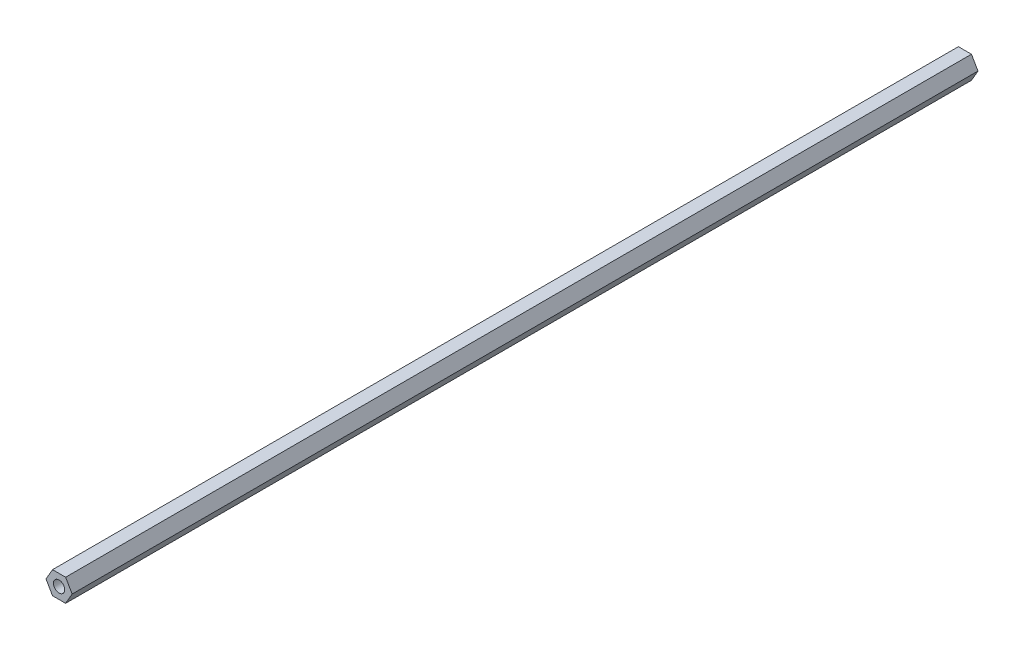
ISO-10303-21;
HEADER;
FILE_DESCRIPTION(('STEP AP214'),'2;1');
FILE_NAME('part.step','',(''),(''),'','','');
FILE_SCHEMA(('AUTOMOTIVE_DESIGN { 1 0 10303 214 1 1 1 1 }'));
ENDSEC;
DATA;
#1=APPLICATION_CONTEXT('core data for automotive mechanical design processes');
#2=APPLICATION_PROTOCOL_DEFINITION('international standard','automotive_design',2000,#1);
#3=PRODUCT_CONTEXT('',#1,'mechanical');
#4=PRODUCT('Part','Part','',(#3));
#5=PRODUCT_RELATED_PRODUCT_CATEGORY('part','',(#4));
#6=PRODUCT_DEFINITION_FORMATION('','',#4);
#7=PRODUCT_DEFINITION_CONTEXT('part definition',#1,'design');
#8=PRODUCT_DEFINITION('design','',#6,#7);
#9=PRODUCT_DEFINITION_SHAPE('','',#8);
#10=(LENGTH_UNIT() NAMED_UNIT(*) SI_UNIT(.MILLI.,.METRE.));
#11=(NAMED_UNIT(*) PLANE_ANGLE_UNIT() SI_UNIT($,.RADIAN.));
#12=(NAMED_UNIT(*) SI_UNIT($,.STERADIAN.) SOLID_ANGLE_UNIT());
#13=UNCERTAINTY_MEASURE_WITH_UNIT(LENGTH_MEASURE(1.E-05),#10,'distance_accuracy_value','');
#14=(GEOMETRIC_REPRESENTATION_CONTEXT(3) GLOBAL_UNCERTAINTY_ASSIGNED_CONTEXT((#13)) GLOBAL_UNIT_ASSIGNED_CONTEXT((#10,
#11,#12)) REPRESENTATION_CONTEXT('',''));
#15=CARTESIAN_POINT('',(0.,0.,0.));
#16=DIRECTION('',(0.,0.,1.));
#17=DIRECTION('',(1.,0.,0.));
#18=AXIS2_PLACEMENT_3D('',#15,#16,#17);
#19=CARTESIAN_POINT('',(3.464101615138,-6.,-160.));
#20=DIRECTION('',(0.,1.,0.));
#21=DIRECTION('',(1.,0.,0.));
#22=AXIS2_PLACEMENT_3D('',#19,#20,#21);
#23=PLANE('',#22);
#24=DIRECTION('',(0.,0.,1.));
#25=VECTOR('',#24,1.);
#26=CARTESIAN_POINT('',(3.464101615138,-6.,-200.));
#27=LINE('',#26,#25);
#28=CARTESIAN_POINT('',(3.464101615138,-6.,-200.));
#29=VERTEX_POINT('',#28);
#30=CARTESIAN_POINT('',(3.464101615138,-6.,40.));
#31=VERTEX_POINT('',#30);
#32=EDGE_CURVE('E170',#29,#31,#27,.T.);
#33=ORIENTED_EDGE('',*,*,#32,.T.);
#34=DIRECTION('',(-1.,0.,0.));
#35=VECTOR('',#34,1.);
#36=CARTESIAN_POINT('',(3.464101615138,-6.,40.));
#37=LINE('',#36,#35);
#38=CARTESIAN_POINT('',(0.,-6.,40.));
#39=VERTEX_POINT('',#38);
#40=EDGE_CURVE('E133',#31,#39,#37,.T.);
#41=ORIENTED_EDGE('',*,*,#40,.T.);
#42=DIRECTION('',(0.,0.,1.));
#43=VECTOR('',#42,1.);
#44=CARTESIAN_POINT('',(0.,-6.,-200.));
#45=LINE('',#44,#43);
#46=CARTESIAN_POINT('',(0.,-6.,-200.));
#47=VERTEX_POINT('',#46);
#48=EDGE_CURVE('E178',#47,#39,#45,.T.);
#49=ORIENTED_EDGE('',*,*,#48,.F.);
#50=DIRECTION('',(-1.,0.,0.));
#51=VECTOR('',#50,1.);
#52=CARTESIAN_POINT('',(3.464101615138,-6.,-200.));
#53=LINE('',#52,#51);
#54=EDGE_CURVE('E163',#29,#47,#53,.T.);
#55=ORIENTED_EDGE('',*,*,#54,.F.);
#56=EDGE_LOOP('',(#33,#41,#49,#55));
#57=FACE_BOUND('',#56,.T.);
#58=ADVANCED_FACE('F45',(#57),#23,.F.);
#59=CARTESIAN_POINT('',(5.196152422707,-3.,-160.));
#60=DIRECTION('',(-0.866025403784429,0.500000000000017,0.));
#61=DIRECTION('',(0.,0.,1.));
#62=AXIS2_PLACEMENT_3D('',#59,#60,#61);
#63=PLANE('',#62);
#64=DIRECTION('',(0.,0.,1.));
#65=VECTOR('',#64,1.);
#66=CARTESIAN_POINT('',(5.196152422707,-3.,-200.));
#67=LINE('',#66,#65);
#68=CARTESIAN_POINT('',(5.196152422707,-3.,-200.));
#69=VERTEX_POINT('',#68);
#70=CARTESIAN_POINT('',(5.196152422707,-3.,40.));
#71=VERTEX_POINT('',#70);
#72=EDGE_CURVE('E158',#69,#71,#67,.T.);
#73=ORIENTED_EDGE('',*,*,#72,.T.);
#74=DIRECTION('',(0.500000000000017,0.866025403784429,0.));
#75=VECTOR('',#74,1.);
#76=CARTESIAN_POINT('',(3.464101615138,-6.,40.));
#77=LINE('',#76,#75);
#78=EDGE_CURVE('E136',#31,#71,#77,.T.);
#79=ORIENTED_EDGE('',*,*,#78,.F.);
#80=ORIENTED_EDGE('',*,*,#32,.F.);
#81=DIRECTION('',(-0.500000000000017,-0.866025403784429,0.));
#82=VECTOR('',#81,1.);
#83=CARTESIAN_POINT('',(5.196152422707,-3.,-200.));
#84=LINE('',#83,#82);
#85=EDGE_CURVE('E166',#69,#29,#84,.T.);
#86=ORIENTED_EDGE('',*,*,#85,.F.);
#87=EDGE_LOOP('',(#73,#79,#80,#86));
#88=FACE_BOUND('',#87,.T.);
#89=ADVANCED_FACE('F187',(#88),#63,.F.);
#90=CARTESIAN_POINT('',(3.464101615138,0.,-160.));
#91=DIRECTION('',(-0.866025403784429,-0.500000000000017,0.));
#92=DIRECTION('',(-0.500000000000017,0.866025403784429,0.));
#93=AXIS2_PLACEMENT_3D('',#90,#91,#92);
#94=PLANE('',#93);
#95=DIRECTION('',(0.,0.,1.));
#96=VECTOR('',#95,1.);
#97=CARTESIAN_POINT('',(3.464101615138,0.,-200.));
#98=LINE('',#97,#96);
#99=CARTESIAN_POINT('',(3.464101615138,0.,-200.));
#100=VERTEX_POINT('',#99);
#101=CARTESIAN_POINT('',(3.464101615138,0.,40.));
#102=VERTEX_POINT('',#101);
#103=EDGE_CURVE('E156',#100,#102,#98,.T.);
#104=ORIENTED_EDGE('',*,*,#103,.T.);
#105=DIRECTION('',(-0.500000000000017,0.866025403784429,0.));
#106=VECTOR('',#105,1.);
#107=CARTESIAN_POINT('',(5.196152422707,-3.,40.));
#108=LINE('',#107,#106);
#109=EDGE_CURVE('E139',#71,#102,#108,.T.);
#110=ORIENTED_EDGE('',*,*,#109,.F.);
#111=ORIENTED_EDGE('',*,*,#72,.F.);
#112=DIRECTION('',(0.500000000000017,-0.866025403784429,0.));
#113=VECTOR('',#112,1.);
#114=CARTESIAN_POINT('',(3.464101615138,0.,-200.));
#115=LINE('',#114,#113);
#116=EDGE_CURVE('E174',#100,#69,#115,.T.);
#117=ORIENTED_EDGE('',*,*,#116,.F.);
#118=EDGE_LOOP('',(#104,#110,#111,#117));
#119=FACE_BOUND('',#118,.T.);
#120=ADVANCED_FACE('F205',(#119),#94,.F.);
#121=CARTESIAN_POINT('',(0.,0.,-200.));
#122=DIRECTION('',(0.,0.,-1.));
#123=DIRECTION('',(0.,-1.,0.));
#124=AXIS2_PLACEMENT_3D('',#121,#122,#123);
#125=PLANE('',#124);
#126=CARTESIAN_POINT('',(1.732050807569,-3.,-200.));
#127=DIRECTION('',(0.,0.,1.));
#128=DIRECTION('',(-1.,0.,0.));
#129=AXIS2_PLACEMENT_3D('',#126,#127,#128);
#130=CIRCLE('',#129,1.5);
#131=CARTESIAN_POINT('',(0.2320508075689,-3.,-200.));
#132=VERTEX_POINT('',#131);
#133=CARTESIAN_POINT('',(3.232050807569,-3.,-200.));
#134=VERTEX_POINT('',#133);
#135=EDGE_CURVE('E153',#132,#134,#130,.T.);
#136=ORIENTED_EDGE('',*,*,#135,.T.);
#137=CARTESIAN_POINT('',(1.732050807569,-3.,-200.));
#138=DIRECTION('',(0.,0.,1.));
#139=DIRECTION('',(1.,0.,0.));
#140=AXIS2_PLACEMENT_3D('',#137,#138,#139);
#141=CIRCLE('',#140,1.5);
#142=EDGE_CURVE('E149',#134,#132,#141,.T.);
#143=ORIENTED_EDGE('',*,*,#142,.T.);
#144=EDGE_LOOP('',(#136,#143));
#145=FACE_BOUND('',#144,.T.);
#146=DIRECTION('',(1.,0.,0.));
#147=VECTOR('',#146,1.);
#148=CARTESIAN_POINT('',(0.,0.,-200.));
#149=LINE('',#148,#147);
#150=CARTESIAN_POINT('',(0.,0.,-200.));
#151=VERTEX_POINT('',#150);
#152=EDGE_CURVE('E171',#151,#100,#149,.T.);
#153=ORIENTED_EDGE('',*,*,#152,.T.);
#154=ORIENTED_EDGE('',*,*,#116,.T.);
#155=ORIENTED_EDGE('',*,*,#85,.T.);
#156=ORIENTED_EDGE('',*,*,#54,.T.);
#157=DIRECTION('',(-0.500000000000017,0.866025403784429,0.));
#158=VECTOR('',#157,1.);
#159=CARTESIAN_POINT('',(0.,-6.,-200.));
#160=LINE('',#159,#158);
#161=CARTESIAN_POINT('',(-1.732050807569,-3.,-200.));
#162=VERTEX_POINT('',#161);
#163=EDGE_CURVE('E160',#47,#162,#160,.T.);
#164=ORIENTED_EDGE('',*,*,#163,.T.);
#165=DIRECTION('',(0.500000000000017,0.866025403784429,0.));
#166=VECTOR('',#165,1.);
#167=CARTESIAN_POINT('',(-1.732050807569,-3.,-200.));
#168=LINE('',#167,#166);
#169=EDGE_CURVE('E49',#162,#151,#168,.T.);
#170=ORIENTED_EDGE('',*,*,#169,.T.);
#171=EDGE_LOOP('',(#153,#154,#155,#156,#164,#170));
#172=FACE_BOUND('',#171,.T.);
#173=ADVANCED_FACE('F183',(#145,#172),#125,.T.);
#174=CARTESIAN_POINT('',(0.,0.,-160.));
#175=DIRECTION('',(0.,-1.,0.));
#176=DIRECTION('',(0.,0.,-1.));
#177=AXIS2_PLACEMENT_3D('',#174,#175,#176);
#178=PLANE('',#177);
#179=DIRECTION('',(0.,0.,1.));
#180=VECTOR('',#179,1.);
#181=CARTESIAN_POINT('',(0.,0.,-200.));
#182=LINE('',#181,#180);
#183=CARTESIAN_POINT('',(0.,0.,40.));
#184=VERTEX_POINT('',#183);
#185=EDGE_CURVE('E154',#151,#184,#182,.T.);
#186=ORIENTED_EDGE('',*,*,#185,.T.);
#187=DIRECTION('',(1.,0.,0.));
#188=VECTOR('',#187,1.);
#189=CARTESIAN_POINT('',(0.,0.,40.));
#190=LINE('',#189,#188);
#191=EDGE_CURVE('E142',#184,#102,#190,.T.);
#192=ORIENTED_EDGE('',*,*,#191,.T.);
#193=ORIENTED_EDGE('',*,*,#103,.F.);
#194=ORIENTED_EDGE('',*,*,#152,.F.);
#195=EDGE_LOOP('',(#186,#192,#193,#194));
#196=FACE_BOUND('',#195,.T.);
#197=ADVANCED_FACE('F201',(#196),#178,.F.);
#198=CARTESIAN_POINT('',(0.,-6.,-160.));
#199=DIRECTION('',(0.866025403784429,0.500000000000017,0.));
#200=DIRECTION('',(0.,0.,-1.));
#201=AXIS2_PLACEMENT_3D('',#198,#199,#200);
#202=PLANE('',#201);
#203=ORIENTED_EDGE('',*,*,#48,.T.);
#204=DIRECTION('',(0.500000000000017,-0.866025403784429,0.));
#205=VECTOR('',#204,1.);
#206=CARTESIAN_POINT('',(-1.732050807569,-3.,40.));
#207=LINE('',#206,#205);
#208=CARTESIAN_POINT('',(-1.732050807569,-3.,40.));
#209=VERTEX_POINT('',#208);
#210=EDGE_CURVE('E130',#209,#39,#207,.T.);
#211=ORIENTED_EDGE('',*,*,#210,.F.);
#212=DIRECTION('',(0.,0.,1.));
#213=VECTOR('',#212,1.);
#214=CARTESIAN_POINT('',(-1.732050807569,-3.,-200.));
#215=LINE('',#214,#213);
#216=EDGE_CURVE('E152',#162,#209,#215,.T.);
#217=ORIENTED_EDGE('',*,*,#216,.F.);
#218=ORIENTED_EDGE('',*,*,#163,.F.);
#219=EDGE_LOOP('',(#203,#211,#217,#218));
#220=FACE_BOUND('',#219,.T.);
#221=ADVANCED_FACE('F195',(#220),#202,.F.);
#222=CARTESIAN_POINT('',(-1.732050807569,-3.,-160.));
#223=DIRECTION('',(0.866025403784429,-0.500000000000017,0.));
#224=DIRECTION('',(0.,0.,-1.));
#225=AXIS2_PLACEMENT_3D('',#222,#223,#224);
#226=PLANE('',#225);
#227=ORIENTED_EDGE('',*,*,#216,.T.);
#228=DIRECTION('',(-0.500000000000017,-0.866025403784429,0.));
#229=VECTOR('',#228,1.);
#230=CARTESIAN_POINT('',(0.,0.,40.));
#231=LINE('',#230,#229);
#232=EDGE_CURVE('E144',#184,#209,#231,.T.);
#233=ORIENTED_EDGE('',*,*,#232,.F.);
#234=ORIENTED_EDGE('',*,*,#185,.F.);
#235=ORIENTED_EDGE('',*,*,#169,.F.);
#236=EDGE_LOOP('',(#227,#233,#234,#235));
#237=FACE_BOUND('',#236,.T.);
#238=ADVANCED_FACE('F47',(#237),#226,.F.);
#239=CARTESIAN_POINT('',(1.732050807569,-3.,-200.));
#240=DIRECTION('',(0.,0.,1.));
#241=DIRECTION('',(1.,0.,0.));
#242=AXIS2_PLACEMENT_3D('',#239,#240,#241);
#243=CYLINDRICAL_SURFACE('',#242,1.5);
#244=DIRECTION('',(0.,0.,-1.));
#245=VECTOR('',#244,1.);
#246=CARTESIAN_POINT('',(0.2320508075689,-3.,-160.));
#247=LINE('',#246,#245);
#248=CARTESIAN_POINT('',(0.2320508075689,-3.,-181.));
#249=VERTEX_POINT('',#248);
#250=EDGE_CURVE('E12',#249,#132,#247,.T.);
#251=ORIENTED_EDGE('',*,*,#250,.F.);
#252=ORIENTED_EDGE('',*,*,#250,.T.);
#253=ORIENTED_EDGE('',*,*,#142,.F.);
#254=DIRECTION('',(0.,0.,-1.));
#255=VECTOR('',#254,1.);
#256=CARTESIAN_POINT('',(3.232050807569,-3.,-160.));
#257=LINE('',#256,#255);
#258=CARTESIAN_POINT('',(3.232050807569,-3.,-181.));
#259=VERTEX_POINT('',#258);
#260=EDGE_CURVE('E54',#259,#134,#257,.T.);
#261=ORIENTED_EDGE('',*,*,#260,.F.);
#262=ORIENTED_EDGE('',*,*,#260,.T.);
#263=ORIENTED_EDGE('',*,*,#135,.F.);
#264=EDGE_LOOP('',(#251,#252,#253,#261,#262,#263));
#265=FACE_BOUND('',#264,.T.);
#266=DIRECTION('',(0.,0.,-1.));
#267=VECTOR('',#266,1.);
#268=CARTESIAN_POINT('',(0.2320508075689,-3.,40.));
#269=LINE('',#268,#267);
#270=CARTESIAN_POINT('',(0.2320508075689,-3.,40.));
#271=VERTEX_POINT('',#270);
#272=CARTESIAN_POINT('',(0.2320508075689,-3.,-180.));
#273=VERTEX_POINT('',#272);
#274=EDGE_CURVE('E123',#271,#273,#269,.T.);
#275=ORIENTED_EDGE('',*,*,#274,.T.);
#276=ORIENTED_EDGE('',*,*,#274,.F.);
#277=CARTESIAN_POINT('',(1.732050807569,-3.,40.));
#278=DIRECTION('',(0.,0.,-1.));
#279=DIRECTION('',(1.,0.,0.));
#280=AXIS2_PLACEMENT_3D('',#277,#278,#279);
#281=CIRCLE('',#280,1.5);
#282=CARTESIAN_POINT('',(3.232050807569,-3.,40.));
#283=VERTEX_POINT('',#282);
#284=EDGE_CURVE('E128',#283,#271,#281,.T.);
#285=ORIENTED_EDGE('',*,*,#284,.F.);
#286=DIRECTION('',(0.,0.,-1.));
#287=VECTOR('',#286,1.);
#288=CARTESIAN_POINT('',(3.232050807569,-3.,40.));
#289=LINE('',#288,#287);
#290=CARTESIAN_POINT('',(3.232050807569,-3.,-180.));
#291=VERTEX_POINT('',#290);
#292=EDGE_CURVE('E117',#283,#291,#289,.T.);
#293=ORIENTED_EDGE('',*,*,#292,.T.);
#294=ORIENTED_EDGE('',*,*,#292,.F.);
#295=CARTESIAN_POINT('',(1.732050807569,-3.,40.));
#296=DIRECTION('',(0.,0.,-1.));
#297=DIRECTION('',(-1.,0.,0.));
#298=AXIS2_PLACEMENT_3D('',#295,#296,#297);
#299=CIRCLE('',#298,1.5);
#300=EDGE_CURVE('E120',#271,#283,#299,.T.);
#301=ORIENTED_EDGE('',*,*,#300,.F.);
#302=EDGE_LOOP('',(#275,#276,#285,#293,#294,#301));
#303=FACE_BOUND('',#302,.T.);
#304=ADVANCED_FACE('F119',(#265,#303),#243,.F.);
#305=CARTESIAN_POINT('',(0.,0.,40.));
#306=DIRECTION('',(0.,0.,-1.));
#307=DIRECTION('',(0.,-1.,0.));
#308=AXIS2_PLACEMENT_3D('',#305,#306,#307);
#309=PLANE('',#308);
#310=ORIENTED_EDGE('',*,*,#284,.T.);
#311=ORIENTED_EDGE('',*,*,#300,.T.);
#312=EDGE_LOOP('',(#310,#311));
#313=FACE_BOUND('',#312,.T.);
#314=ORIENTED_EDGE('',*,*,#210,.T.);
#315=ORIENTED_EDGE('',*,*,#40,.F.);
#316=ORIENTED_EDGE('',*,*,#78,.T.);
#317=ORIENTED_EDGE('',*,*,#109,.T.);
#318=ORIENTED_EDGE('',*,*,#191,.F.);
#319=ORIENTED_EDGE('',*,*,#232,.T.);
#320=EDGE_LOOP('',(#314,#315,#316,#317,#318,#319));
#321=FACE_BOUND('',#320,.T.);
#322=ADVANCED_FACE('F126',(#313,#321),#309,.F.);
#323=CLOSED_SHELL('',(#58,#89,#120,#173,#197,#221,#238,#304,#322));
#324=MANIFOLD_SOLID_BREP('B2',#323);
#325=ADVANCED_BREP_SHAPE_REPRESENTATION('',(#18,#324),#14);
#326=SHAPE_DEFINITION_REPRESENTATION(#9,#325);
ENDSEC;
END-ISO-10303-21;
